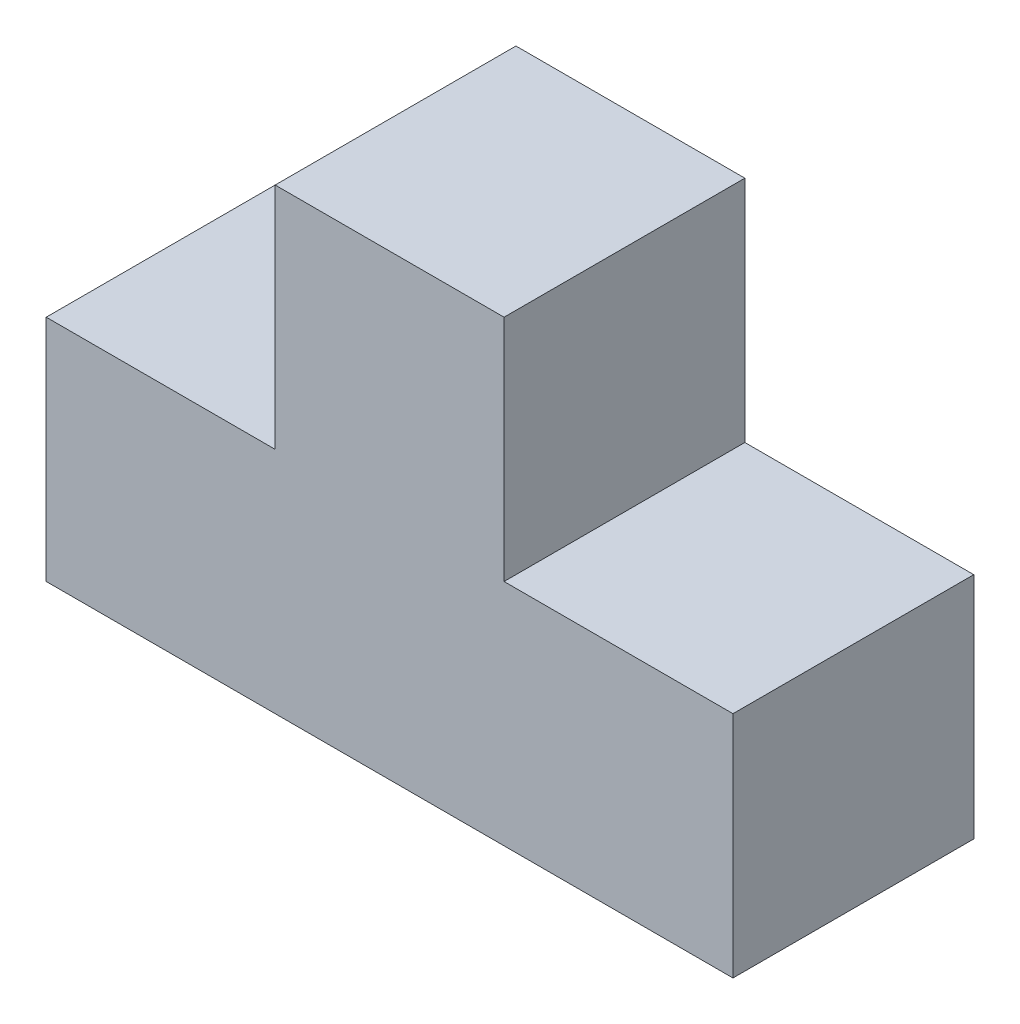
from build123d import *

# Parameters (mm, degrees)
EXTRUDE1_DEPTH = 38.1


with BuildPart() as part:
    # Sketch1 → Extrude1 (new body)
    with BuildSketch(Plane.XY):
        Polygon((-36.907503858, 0), (-36.907503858, 36.220852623), (-0.686651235, 36.220852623), (-0.686651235, 72.441705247), (35.534201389, 72.441705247), (35.534201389, 36.220852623), (71.755054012, 36.220852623), (71.755054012, 0), align=None)
    extrude(amount=EXTRUDE1_DEPTH)


solid = part.part
